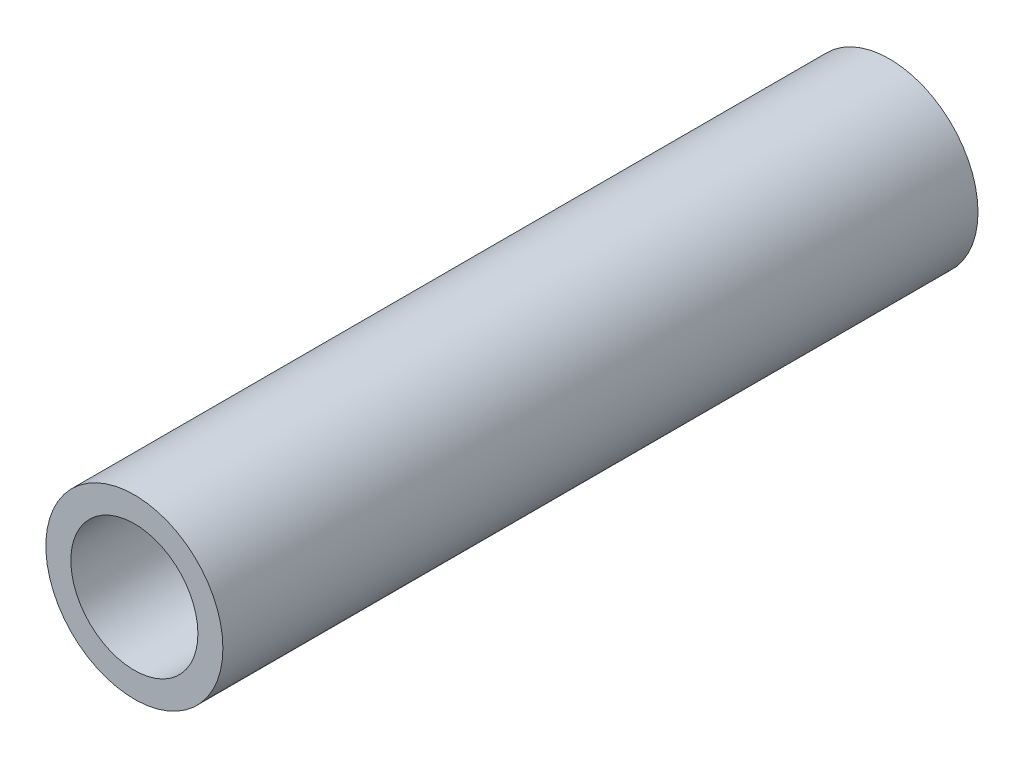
from build123d import *

# Parameters (mm, degrees)
SKETCH1_R           = 10.795
SKETCH1_R_2         = 7.747
BOSS_EXTRUDE1_DEPTH = 92.075


with BuildPart() as part:
    # Sketch1 → Boss-Extrude1 (new body)
    with BuildSketch(Plane.XY):
        Circle(SKETCH1_R)
        Circle(SKETCH1_R_2, mode=Mode.SUBTRACT)
    extrude(amount=BOSS_EXTRUDE1_DEPTH)


solid = part.part
